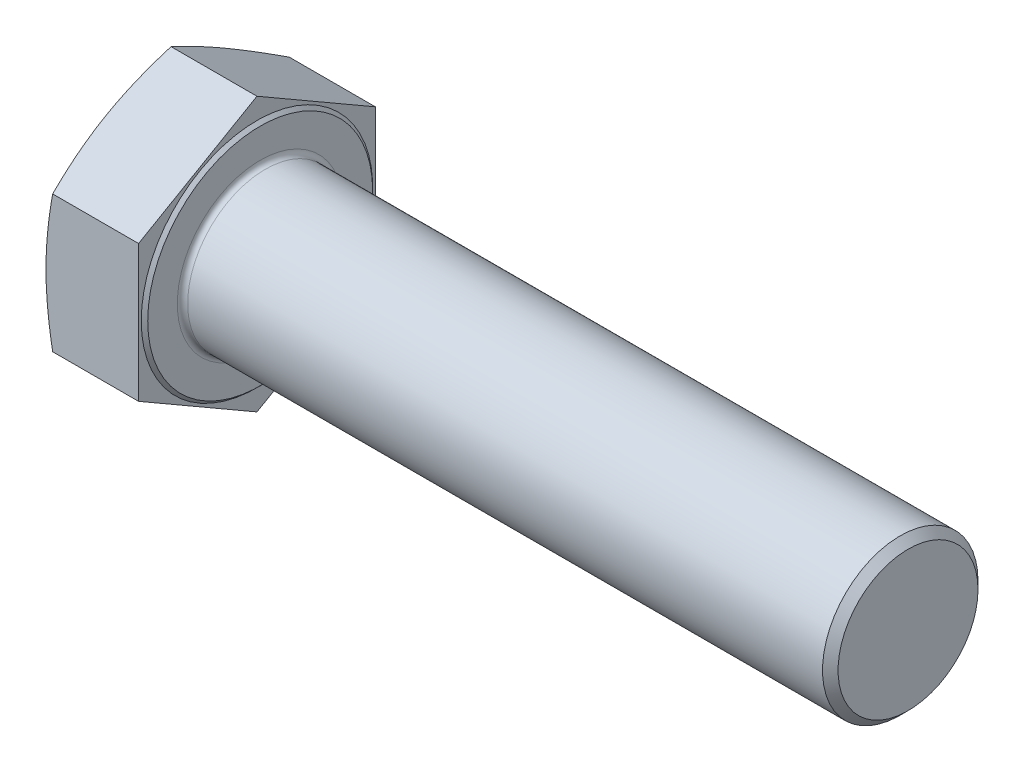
from build123d import *

# Parameters (mm, degrees)
BASEHEAD_DEPTH = 29.58
SKETCH5_R      = 24
BASEBODY_DEPTH = 200
CHAMFER1_SIZE  = 2.4
HEADFILLET_R   = 1.6


with BuildPart() as part:
    # Sketch2 → BaseHead (new body)
    with BuildSketch(Plane(origin=(0, 0, 0), x_dir=(0, 0, -1), z_dir=(1, 0, 0))):
        Polygon((0, -42.204304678), (36.55, -21.102152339), (36.55, 21.102152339), (0, 42.204304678), (-36.55, 21.102152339), (-36.55, -21.102152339), align=None)
    extrude(amount=BASEHEAD_DEPTH)

    # Sketch3 → BearingFace (revolve, cut)
    with BuildSketch(Plane.XY, mode=Mode.PRIVATE) as bearingface_sk:
        Polygon((29.58, 42.204304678), (29.58, 34.725), (28.58, 35.725), (28.58, 42.204304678), align=None)
    revolve(bearingface_sk.sketch.rotate(Axis((-0.957090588, 0, 0), (1, 0, 0)), 90), axis=Axis((-0.957090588, 0, 0), (1, 0, 0)), mode=Mode.SUBTRACT)

    # Sketch4 → HeadChamfer (revolve, cut)
    with BuildSketch(Plane.XY):
        Polygon((0, 42.204304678), (2.057998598, 42.204304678), (0, 36.55), align=None)
    revolve(axis=Axis((-0.493528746, 0, 0), (1, 0, 0)), mode=Mode.SUBTRACT)

    # Sketch5 → BaseBody (add)
    with BuildSketch(Plane(origin=(29.58, 0, 0), x_dir=(0, 0, -1), z_dir=(1, 0, 0))):
        Circle(SKETCH5_R)
    extrude(amount=BASEBODY_DEPTH)

    # Chamfer1
    chamfer1_edges = [part.edges().sort_by_distance(p)[0] for p in [
        (229.58, 0, 24),
    ]]
    chamfer(chamfer1_edges, length=CHAMFER1_SIZE)

    # HeadFillet
    headfillet_edges = [part.edges().sort_by_distance(p)[0] for p in [
        (29.58, 0, 24),
    ]]
    fillet(headfillet_edges, radius=HEADFILLET_R)


solid = part.part
